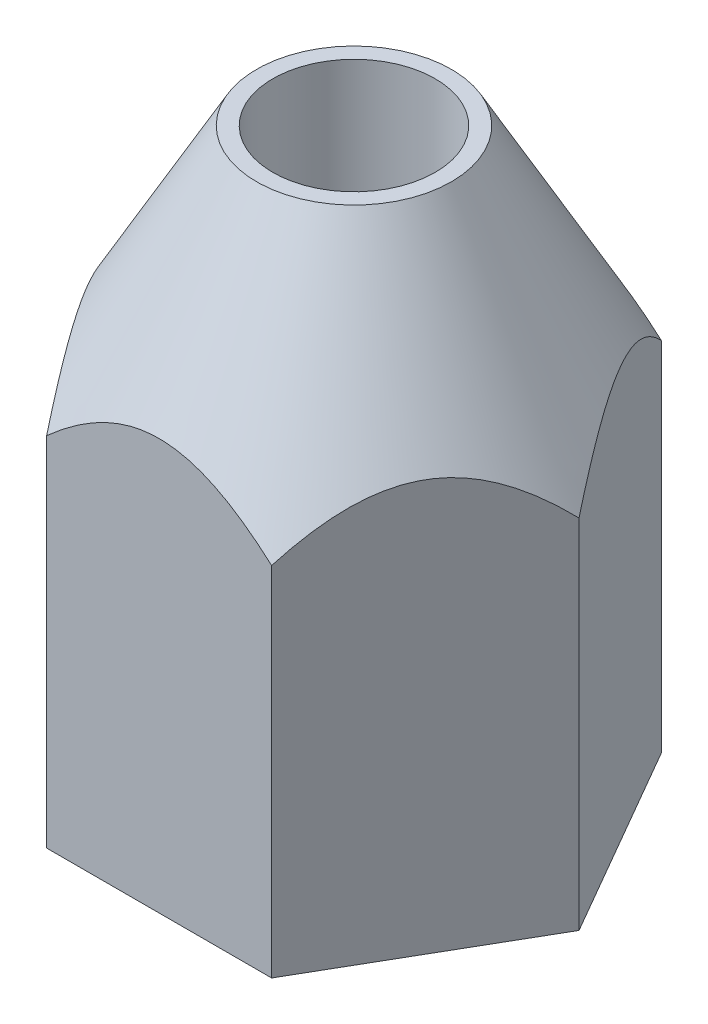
from build123d import *

# Parameters (mm, degrees)
BOSS_EXTRU_1_DEPTH = 18


with BuildPart() as part:
    # Esquisse2 → Boss.-Extru.1 (new body)
    with BuildSketch(Plane(origin=(0, 0, 0), x_dir=(1, 0, 0), z_dir=(0, 1, 0))):
        Polygon((3.464101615, -6), (6.92820323, 0), (3.464101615, 6), (-3.464101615, 6), (-6.92820323, 0), (-3.464101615, -6), align=None)
    extrude(amount=BOSS_EXTRU_1_DEPTH)

    # Esquisse3 → Enl_vement de mati_re-R_volution1 (revolve, cut)
    with BuildSketch(Plane.XY):
        Polygon((3, 18), (6.92820323, 11), (6.92820323, 18), align=None)
        Polygon((0, 0), (0, 18), (2.5, 18), (2.5, 12.297564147), (4, 11.5), (4, 0), align=None)
    revolve(axis=Axis((0, 0, 0), (0, 1, 0)), mode=Mode.SUBTRACT)


solid = part.part
